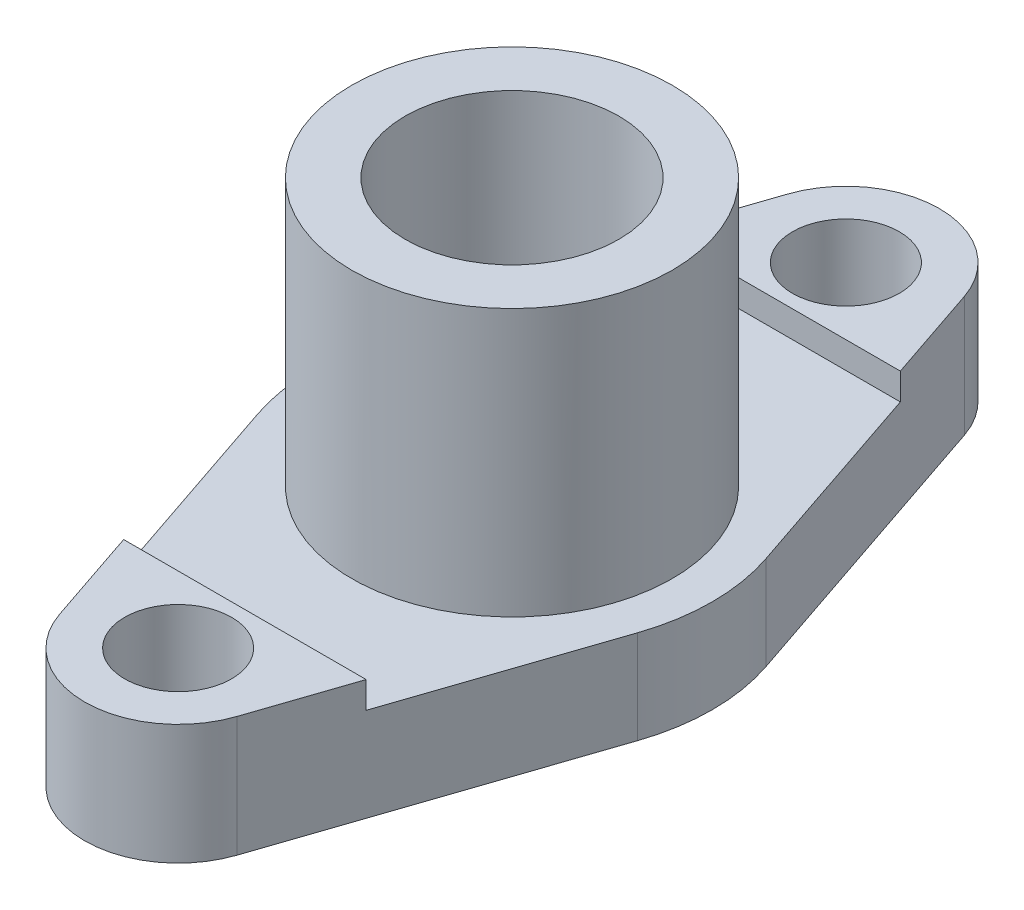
from build123d import *

# Parameters (mm, degrees)
SKETCH_1_R      = 12
SKETCH_1_R_2    = 8
EXTRUDE_1_DEPTH = 27
SKETCH_2_R      = 4
SKETCH_2_R_2    = 8
EXTRUDE_2_DEPTH = 7
SKETCH_3_R      = 4
EXTRUDE_3_DEPTH = 2


with BuildPart() as part:
    # Sketch 1 → Extrude 1 (new body)
    with BuildSketch(Plane(origin=(0, 0, 0), x_dir=(1, 0, 0), z_dir=(0, 1, 0))):
        with Locations(Location((0, 0, 0), (0, 0, 270))):
            Circle(SKETCH_1_R)
        with Locations(Location((0, 0, 0), (0, 0, 270))):
            Circle(SKETCH_1_R_2, mode=Mode.SUBTRACT)
    extrude(amount=EXTRUDE_1_DEPTH)

    # Sketch 2 → Extrude 2 (add)
    with BuildSketch(Plane.XZ):
        with BuildLine():
            Line((14.21127279, -4.800011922), (6.631921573, -27.240003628))
            ThreePointArc((6.631921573, -27.240003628), (0, -32), (-6.631921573, -27.240003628))
            Line((-6.631921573, -27.240003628), (-14.21127279, -4.800011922))
            ThreePointArc((-14.21127279, -4.800011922), (-15.000012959, 0), (-14.21127279, 4.800011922))
            Line((-14.21127279, 4.800011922), (-6.631921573, 27.240003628))
            ThreePointArc((-6.631921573, 27.240003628), (0, 32), (6.631921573, 27.240003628))
            Line((6.631921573, 27.240003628), (14.21127279, 4.800011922))
            ThreePointArc((14.21127279, 4.800011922), (15.000012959, 0), (14.21127279, -4.800011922))
        make_face()
        with Locations(Location((0, -25, 0), (0, 0, 270))):
            Circle(SKETCH_2_R, mode=Mode.SUBTRACT)
        with Locations(Location((0, 25, 0), (0, 0, 270))):
            Circle(SKETCH_2_R, mode=Mode.SUBTRACT)
        with Locations(Location((0, 0, 0), (0, 0, 90))):
            Circle(SKETCH_2_R_2, mode=Mode.SUBTRACT)
    extrude(amount=-EXTRUDE_2_DEPTH)

    # Sketch 3 → Extrude 3 (add)
    # profile 1 of 2: a face of its own
    with BuildSketch(Plane(origin=(0, 7, 0), x_dir=(-1, 0, 0), z_dir=(0, 1, 0))):
        with BuildLine():
            Line((-9.077311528, -20), (9.077311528, -20))
            Line((9.077311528, -20), (6.631921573, -27.240003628))
            ThreePointArc((6.631921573, -27.240003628), (0, -32), (-6.631921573, -27.240003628))
            Line((-6.631921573, -27.240003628), (-9.077311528, -20))
        make_face()
        with Locations(Location((0, -25, 0), (0, 0, 270))):
            Circle(SKETCH_3_R, mode=Mode.SUBTRACT)
    # profile 2 of 2: a face of its own
    with BuildSketch(Plane(origin=(0, 7, 0), x_dir=(-1, 0, 0), z_dir=(0, 1, 0))):
        with BuildLine():
            Line((-9.077311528, 20), (-6.631921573, 27.240003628))
            ThreePointArc((-6.631921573, 27.240003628), (0, 32), (6.631921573, 27.240003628))
            Line((6.631921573, 27.240003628), (9.077311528, 20))
            Line((9.077311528, 20), (-9.077311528, 20))
        make_face()
        with Locations(Location((0, 25, 0), (0, 0, 270))):
            Circle(SKETCH_3_R, mode=Mode.SUBTRACT)
    extrude(amount=EXTRUDE_3_DEPTH)


solid = part.part
